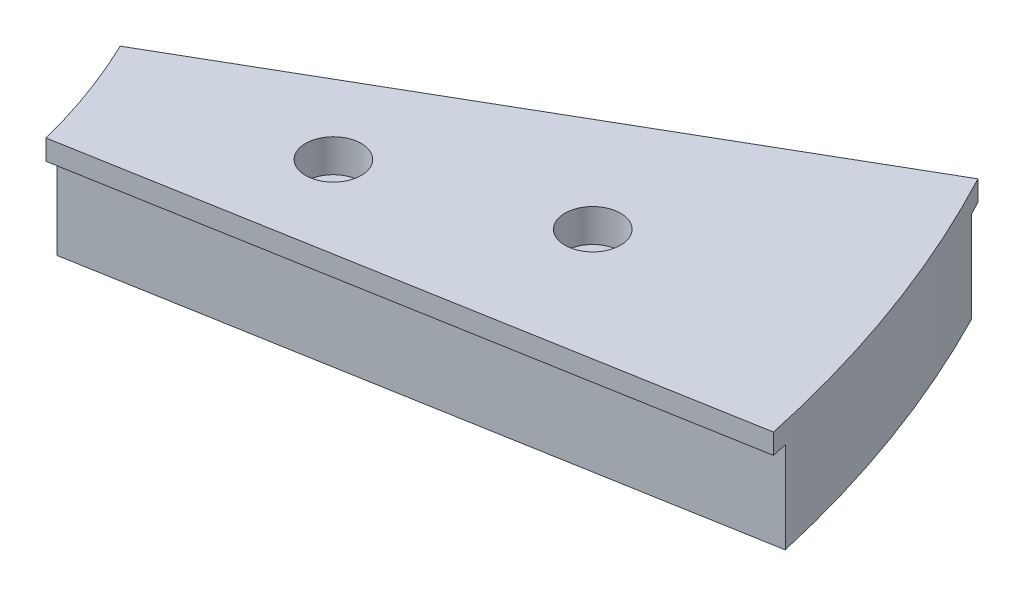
from build123d import *

# Parameters (mm, degrees)
BASE_EXTRUDE_DEPTH      = 17.4625
CUT_EXTRUDE2_DEPTH      = 14.2875
CBORE10_OV1_D           = 5.6134
CBORE10_OV1_DEPTH       = 203.2
CBORE10_OV1_CBORE_D     = 8.73125
CBORE10_OV1_CBORE_DEPTH = 5.159375
CBORE10_OV2_D           = 5.6134
CBORE10_OV2_DEPTH       = 203.2
CBORE10_OV2_CBORE_D     = 8.73125
CBORE10_OV2_CBORE_DEPTH = 5.159375
HOLE3_D                 = 4.365625
HOLE3_DEPTH             = 14.2875
HOLE3_CBORE_D           = 4.7879
HOLE3_CBORE_DEPTH       = 7.14375
HOLE3_TIP               = 1.31156607
HOLE4_D                 = 4.365625
HOLE4_DEPTH             = 14.2875
HOLE4_CBORE_D           = 4.7879
HOLE4_CBORE_DEPTH       = 7.14375
HOLE4_TIP               = 1.31156607


with BuildPart() as part:
    # Sketch1 → Base-Extrude (new body)
    with BuildSketch(Plane(origin=(0, 0, 0), x_dir=(1, 0, 0), z_dir=(0, 1, 0))):
        with BuildLine():
            Line((87.207101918, 42.100151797), (172.560951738, 91.379219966))
            ThreePointArc((172.560951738, 91.379219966), (183.486730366, 66.783708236), (190.926788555, 40.919498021))
            Line((190.926788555, 40.919498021), (93.865971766, 23.805057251))
            ThreePointArc((93.865971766, 23.805057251), (90.997484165, 33.120375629), (87.207101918, 42.100151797))
        make_face()
    extrude(amount=BASE_EXTRUDE_DEPTH)

    # Sketch2 → Cut-Extrude2 (cut)
    with BuildSketch(Plane(origin=(0, 0, 0), x_dir=(1, 0, 0), z_dir=(0, 1, 0))):
        Polygon((76.2, 32.944241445), (200.025, 104.434638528), (200.025, 44.986878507), (76.2, 23.153190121), (76.2, 0), (228.6, 0), (228.6, 127), (76.2, 127), align=None)
    extrude(amount=CUT_EXTRUDE2_DEPTH, mode=Mode.SUBTRACT)

    # CBORE10-OV1
    with Locations(Plane(origin=(184.022600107, 17.4625, -50.424829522), x_dir=(-1, 0, 0), z_dir=(0, 1, 0))):
        with Locations((34.846396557, -3.870868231)):
            CounterBoreHole(CBORE10_OV1_D / 2, CBORE10_OV1_CBORE_D / 2, CBORE10_OV1_CBORE_DEPTH, depth=CBORE10_OV1_DEPTH)

    # CBORE10-OV2
    with Locations(Plane(origin=(132.637001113, 17.4625, -45.507547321), x_dir=(-1, 0, 0), z_dir=(0, 1, 0))):
        with Locations((13.296038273, 2.070989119)):
            CounterBoreHole(CBORE10_OV2_D / 2, CBORE10_OV2_CBORE_D / 2, CBORE10_OV2_CBORE_DEPTH, depth=CBORE10_OV2_DEPTH)

    # Hole3
    with Locations(Plane(origin=(106.929105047, 0, -17.944447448), x_dir=(1, 0, 0), z_dir=(0, -1, 0))):
        with Locations((-2.505762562, -20.062540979)):
            CounterBoreHole(HOLE3_D / 2, HOLE3_CBORE_D / 2, HOLE3_CBORE_DEPTH, depth=HOLE3_DEPTH)
            with Locations((0, 0, -(HOLE3_DEPTH + HOLE3_TIP / 2))):  # 118° drill point
                Cone(0, HOLE3_D / 2, HOLE3_TIP, mode=Mode.SUBTRACT)

    # Hole4
    with Locations(Plane(origin=(158.508623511, 0, -36.728630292), x_dir=(1, 0, 0), z_dir=(0, -1, 0))):
        with Locations((5.585200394, -22.996637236)):
            CounterBoreHole(HOLE4_D / 2, HOLE4_CBORE_D / 2, HOLE4_CBORE_DEPTH, depth=HOLE4_DEPTH)
            with Locations((0, 0, -(HOLE4_DEPTH + HOLE4_TIP / 2))):  # 118° drill point
                Cone(0, HOLE4_D / 2, HOLE4_TIP, mode=Mode.SUBTRACT)


solid = part.part
